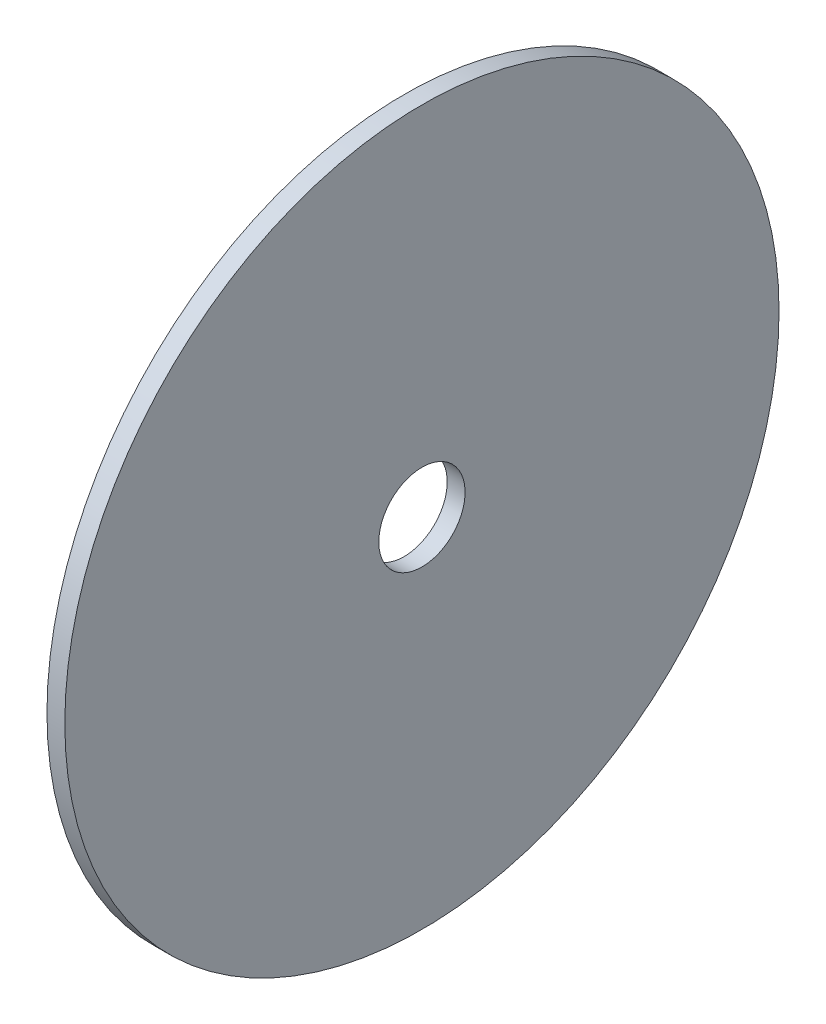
from build123d import *

# Parameters (mm, degrees)
ESQUISSE1_W = 3
ESQUISSE1_H = 52.75


with BuildPart() as part:
    # Esquisse1 → Base-R_volution (revolve)
    with BuildSketch(Plane(origin=(0, 0, 0), x_dir=(1, 0, 0), z_dir=(0, 1, 0)), mode=Mode.PRIVATE) as base_r_volution_sk:
        with Locations((1.5, 33.625)):
            Rectangle(ESQUISSE1_W, ESQUISSE1_H)
    revolve(base_r_volution_sk.sketch.rotate(Axis((0, 0, 0), (1, 0, 0)), 180), axis=Axis((0, 0, 0), (1, 0, 0)))


solid = part.part
